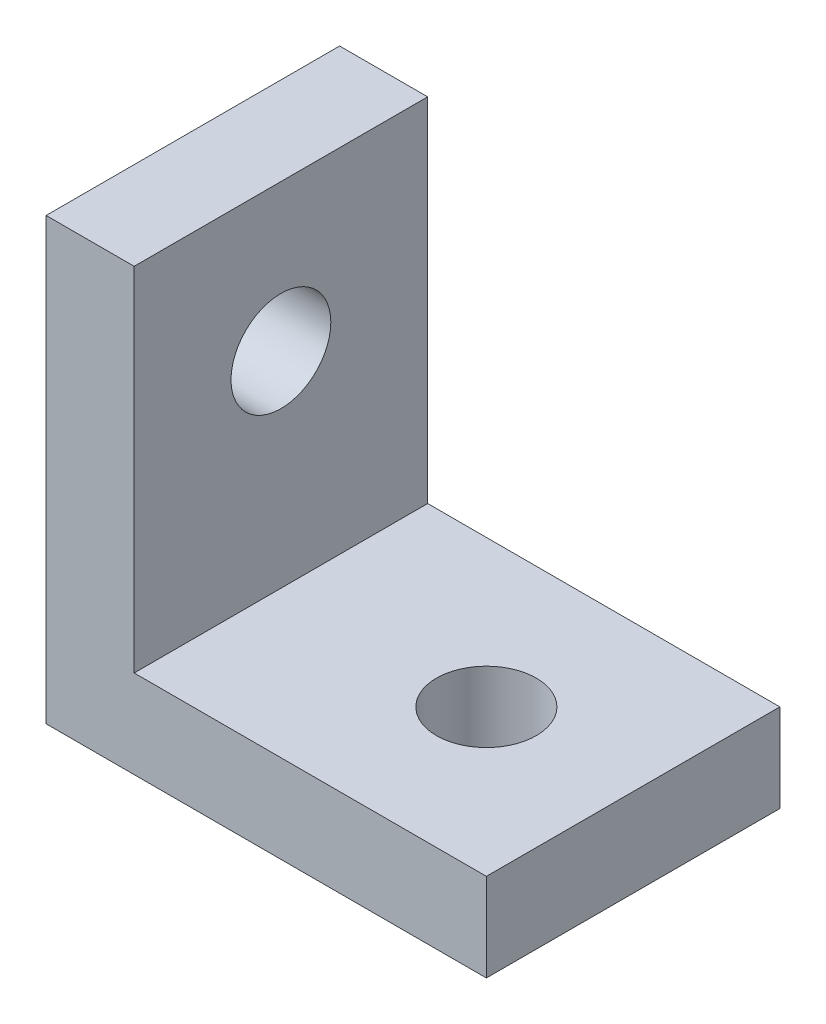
from build123d import *

# Parameters (mm, degrees)
SKETCH_1_W              = 15
SKETCH_1_H              = 15
EXTRUDE_1_DEPTH         = 10
SKETCH_2_W              = 24
SKETCH_2_H              = 24
CUT_EXTRUDE_1_DEPTH     = 10
HOLE_WIZARD_3_4_3_4_1_D = 3.4
HOLE_WIZARD_3_4_3_4_2_D = 3.4


with BuildPart() as part:
    # Sketch 1 → Extrude 1 (new body)
    with BuildSketch(Plane.XY):
        Rectangle(SKETCH_1_W, SKETCH_1_H)
    extrude(amount=EXTRUDE_1_DEPTH)

    # Sketch 2 → Cut-Extrude 1 (cut)
    with BuildSketch(Plane.XY.offset(10)):
        with Locations((7.5, 7.5)):
            Rectangle(SKETCH_2_W, SKETCH_2_H)
    extrude(amount=-CUT_EXTRUDE_1_DEPTH, mode=Mode.SUBTRACT)

    # Hole Wizard 3.4 _3.4_ _1 (through all)
    with Locations(Plane(origin=(-4.5, 0, 0), x_dir=(0, 0, -1), z_dir=(1, 0, 0))):
        with Locations((-5, 2.5)):
            Hole(HOLE_WIZARD_3_4_3_4_1_D / 2)

    # Hole Wizard 3.4 _3.4_ _2 (through all)
    with Locations(Plane(origin=(0, -4.5, 0), x_dir=(1, 0, 0), z_dir=(0, 1, 0))):
        with Locations((2.5, -5)):
            Hole(HOLE_WIZARD_3_4_3_4_2_D / 2)


solid = part.part
